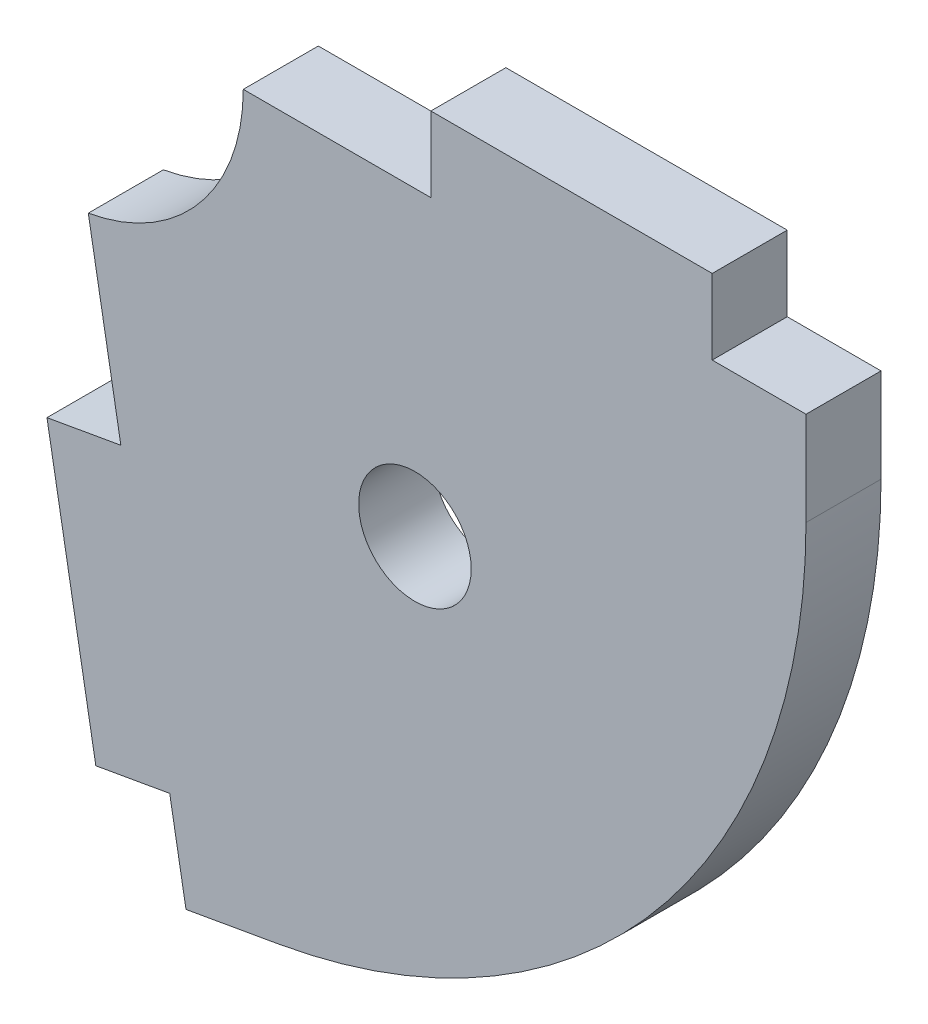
from build123d import *

# Parameters (mm, degrees)
SKETCH1_R           = 3
BOSS_EXTRUDE1_DEPTH = 4


with BuildPart() as part:
    # Sketch1 → Boss-Extrude1 (new body)
    with BuildSketch(Plane.XY):
        with BuildLine():
            Line((10, 0), (20, 0))
            Line((20, 0), (20, 4))
            Line((20, 4), (35, 4))
            Line((35, 4), (35, 0))
            Line((35, 0), (40, 0))
            Line((40, 0), (40, -5))
            ThreePointArc((40, -5), (32.035864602, -26.881282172), (11.869965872, -38.524069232))
            Line((11.869965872, -38.524069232), (6.945927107, -39.39231012))
            Line((6.945927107, -39.39231012), (6.077686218, -34.468271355))
            Line((6.077686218, -34.468271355), (2.138455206, -35.162864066))
            Line((2.138455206, -35.162864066), (-0.466267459, -20.390747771))
            Line((-0.466267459, -20.390747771), (3.472963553, -19.69615506))
            Line((3.472963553, -19.69615506), (1.736481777, -9.84807753))
            ThreePointArc((1.736481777, -9.84807753), (7.660444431, -6.427876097), (10, 0))
        make_face()
        with Locations((19.151111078, -16.069690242)):
            Circle(SKETCH1_R, mode=Mode.SUBTRACT)
    extrude(amount=BOSS_EXTRUDE1_DEPTH)


solid = part.part
